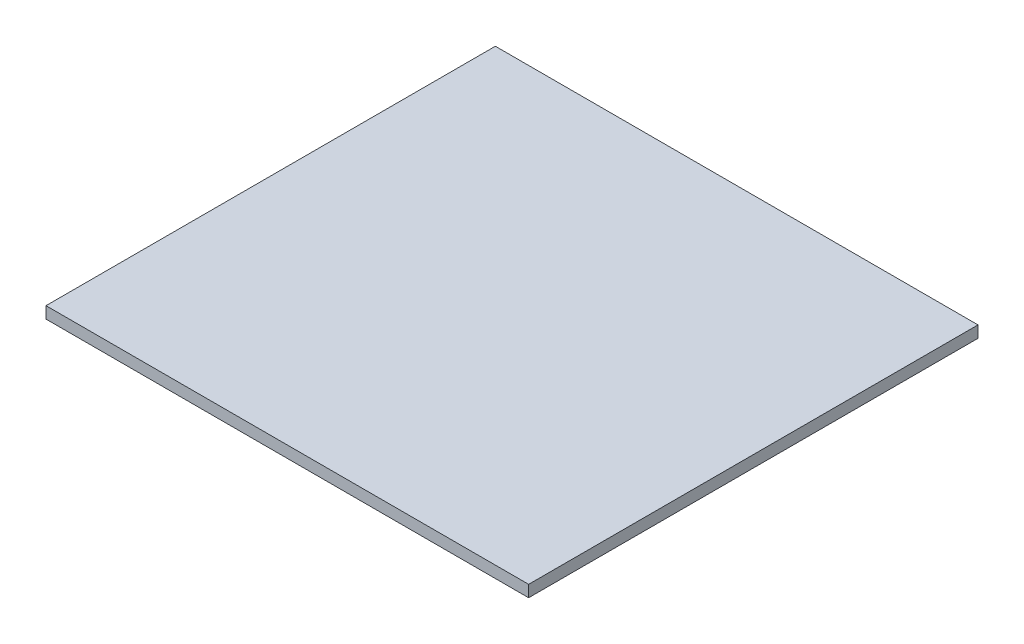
ISO-10303-21;
HEADER;
FILE_DESCRIPTION(('STEP AP214'),'2;1');
FILE_NAME('part.step','',(''),(''),'','','');
FILE_SCHEMA(('AUTOMOTIVE_DESIGN { 1 0 10303 214 1 1 1 1 }'));
ENDSEC;
DATA;
#1=APPLICATION_CONTEXT('core data for automotive mechanical design processes');
#2=APPLICATION_PROTOCOL_DEFINITION('international standard','automotive_design',2000,#1);
#3=PRODUCT_CONTEXT('',#1,'mechanical');
#4=PRODUCT('Part','Part','',(#3));
#5=PRODUCT_RELATED_PRODUCT_CATEGORY('part','',(#4));
#6=PRODUCT_DEFINITION_FORMATION('','',#4);
#7=PRODUCT_DEFINITION_CONTEXT('part definition',#1,'design');
#8=PRODUCT_DEFINITION('design','',#6,#7);
#9=PRODUCT_DEFINITION_SHAPE('','',#8);
#10=(LENGTH_UNIT() NAMED_UNIT(*) SI_UNIT(.MILLI.,.METRE.));
#11=(NAMED_UNIT(*) PLANE_ANGLE_UNIT() SI_UNIT($,.RADIAN.));
#12=(NAMED_UNIT(*) SI_UNIT($,.STERADIAN.) SOLID_ANGLE_UNIT());
#13=UNCERTAINTY_MEASURE_WITH_UNIT(LENGTH_MEASURE(1.E-05),#10,'distance_accuracy_value','');
#14=(GEOMETRIC_REPRESENTATION_CONTEXT(3) GLOBAL_UNCERTAINTY_ASSIGNED_CONTEXT((#13)) GLOBAL_UNIT_ASSIGNED_CONTEXT((#10,
#11,#12)) REPRESENTATION_CONTEXT('',''));
#15=CARTESIAN_POINT('',(0.,0.,0.));
#16=DIRECTION('',(0.,0.,1.));
#17=DIRECTION('',(1.,0.,0.));
#18=AXIS2_PLACEMENT_3D('',#15,#16,#17);
#19=CARTESIAN_POINT('',(145.,7.,135.));
#20=DIRECTION('',(-1.,0.,0.));
#21=DIRECTION('',(0.,0.,1.));
#22=AXIS2_PLACEMENT_3D('',#19,#20,#21);
#23=PLANE('',#22);
#24=DIRECTION('',(0.,0.,-1.));
#25=VECTOR('',#24,1.);
#26=CARTESIAN_POINT('',(145.,0.,135.));
#27=LINE('',#26,#25);
#28=CARTESIAN_POINT('',(145.,0.,135.));
#29=VERTEX_POINT('',#28);
#30=CARTESIAN_POINT('',(145.,0.,-135.));
#31=VERTEX_POINT('',#30);
#32=EDGE_CURVE('E100',#29,#31,#27,.T.);
#33=ORIENTED_EDGE('',*,*,#32,.T.);
#34=DIRECTION('',(0.,-1.,0.));
#35=VECTOR('',#34,1.);
#36=CARTESIAN_POINT('',(145.,7.,-135.));
#37=LINE('',#36,#35);
#38=CARTESIAN_POINT('',(145.,7.,-135.));
#39=VERTEX_POINT('',#38);
#40=EDGE_CURVE('E11',#39,#31,#37,.T.);
#41=ORIENTED_EDGE('',*,*,#40,.F.);
#42=DIRECTION('',(0.,0.,-1.));
#43=VECTOR('',#42,1.);
#44=CARTESIAN_POINT('',(145.,7.,135.));
#45=LINE('',#44,#43);
#46=CARTESIAN_POINT('',(145.,7.,135.));
#47=VERTEX_POINT('',#46);
#48=EDGE_CURVE('E88',#47,#39,#45,.T.);
#49=ORIENTED_EDGE('',*,*,#48,.F.);
#50=DIRECTION('',(0.,-1.,0.));
#51=VECTOR('',#50,1.);
#52=CARTESIAN_POINT('',(145.,7.,135.));
#53=LINE('',#52,#51);
#54=EDGE_CURVE('E96',#47,#29,#53,.T.);
#55=ORIENTED_EDGE('',*,*,#54,.T.);
#56=EDGE_LOOP('',(#33,#41,#49,#55));
#57=FACE_BOUND('',#56,.T.);
#58=ADVANCED_FACE('F37',(#57),#23,.F.);
#59=CARTESIAN_POINT('',(-145.,7.,-135.));
#60=DIRECTION('',(0.,0.,1.));
#61=DIRECTION('',(1.,0.,0.));
#62=AXIS2_PLACEMENT_3D('',#59,#60,#61);
#63=PLANE('',#62);
#64=DIRECTION('',(-1.,0.,0.));
#65=VECTOR('',#64,1.);
#66=CARTESIAN_POINT('',(-145.,0.,-135.));
#67=LINE('',#66,#65);
#68=CARTESIAN_POINT('',(-145.,0.,-135.));
#69=VERTEX_POINT('',#68);
#70=EDGE_CURVE('E92',#31,#69,#67,.T.);
#71=ORIENTED_EDGE('',*,*,#70,.T.);
#72=DIRECTION('',(0.,-1.,0.));
#73=VECTOR('',#72,1.);
#74=CARTESIAN_POINT('',(-145.,7.,-135.));
#75=LINE('',#74,#73);
#76=CARTESIAN_POINT('',(-145.,7.,-135.));
#77=VERTEX_POINT('',#76);
#78=EDGE_CURVE('E45',#77,#69,#75,.T.);
#79=ORIENTED_EDGE('',*,*,#78,.F.);
#80=DIRECTION('',(-1.,0.,0.));
#81=VECTOR('',#80,1.);
#82=CARTESIAN_POINT('',(-145.,7.,-135.));
#83=LINE('',#82,#81);
#84=EDGE_CURVE('E83',#39,#77,#83,.T.);
#85=ORIENTED_EDGE('',*,*,#84,.F.);
#86=ORIENTED_EDGE('',*,*,#40,.T.);
#87=EDGE_LOOP('',(#71,#79,#85,#86));
#88=FACE_BOUND('',#87,.T.);
#89=ADVANCED_FACE('F91',(#88),#63,.F.);
#90=CARTESIAN_POINT('',(-145.,7.,135.));
#91=DIRECTION('',(1.,0.,0.));
#92=DIRECTION('',(0.,0.,-1.));
#93=AXIS2_PLACEMENT_3D('',#90,#91,#92);
#94=PLANE('',#93);
#95=DIRECTION('',(0.,0.,1.));
#96=VECTOR('',#95,1.);
#97=CARTESIAN_POINT('',(-145.,0.,135.));
#98=LINE('',#97,#96);
#99=CARTESIAN_POINT('',(-145.,0.,135.));
#100=VERTEX_POINT('',#99);
#101=EDGE_CURVE('E70',#69,#100,#98,.T.);
#102=ORIENTED_EDGE('',*,*,#101,.T.);
#103=DIRECTION('',(0.,-1.,0.));
#104=VECTOR('',#103,1.);
#105=CARTESIAN_POINT('',(-145.,7.,135.));
#106=LINE('',#105,#104);
#107=CARTESIAN_POINT('',(-145.,7.,135.));
#108=VERTEX_POINT('',#107);
#109=EDGE_CURVE('E93',#108,#100,#106,.T.);
#110=ORIENTED_EDGE('',*,*,#109,.F.);
#111=DIRECTION('',(0.,0.,1.));
#112=VECTOR('',#111,1.);
#113=CARTESIAN_POINT('',(-145.,7.,135.));
#114=LINE('',#113,#112);
#115=EDGE_CURVE('E86',#77,#108,#114,.T.);
#116=ORIENTED_EDGE('',*,*,#115,.F.);
#117=ORIENTED_EDGE('',*,*,#78,.T.);
#118=EDGE_LOOP('',(#102,#110,#116,#117));
#119=FACE_BOUND('',#118,.T.);
#120=ADVANCED_FACE('F94',(#119),#94,.F.);
#121=CARTESIAN_POINT('',(-145.,7.,135.));
#122=DIRECTION('',(0.,0.,-1.));
#123=DIRECTION('',(-1.,0.,0.));
#124=AXIS2_PLACEMENT_3D('',#121,#122,#123);
#125=PLANE('',#124);
#126=DIRECTION('',(1.,0.,0.));
#127=VECTOR('',#126,1.);
#128=CARTESIAN_POINT('',(-145.,0.,135.));
#129=LINE('',#128,#127);
#130=EDGE_CURVE('E76',#100,#29,#129,.T.);
#131=ORIENTED_EDGE('',*,*,#130,.T.);
#132=ORIENTED_EDGE('',*,*,#54,.F.);
#133=DIRECTION('',(1.,0.,0.));
#134=VECTOR('',#133,1.);
#135=CARTESIAN_POINT('',(-145.,7.,135.));
#136=LINE('',#135,#134);
#137=EDGE_CURVE('E53',#108,#47,#136,.T.);
#138=ORIENTED_EDGE('',*,*,#137,.F.);
#139=ORIENTED_EDGE('',*,*,#109,.T.);
#140=EDGE_LOOP('',(#131,#132,#138,#139));
#141=FACE_BOUND('',#140,.T.);
#142=ADVANCED_FACE('F107',(#141),#125,.F.);
#143=CARTESIAN_POINT('',(0.,7.,0.));
#144=DIRECTION('',(0.,-1.,0.));
#145=DIRECTION('',(0.,0.,-1.));
#146=AXIS2_PLACEMENT_3D('',#143,#144,#145);
#147=PLANE('',#146);
#148=ORIENTED_EDGE('',*,*,#48,.T.);
#149=ORIENTED_EDGE('',*,*,#84,.T.);
#150=ORIENTED_EDGE('',*,*,#115,.T.);
#151=ORIENTED_EDGE('',*,*,#137,.T.);
#152=EDGE_LOOP('',(#148,#149,#150,#151));
#153=FACE_BOUND('',#152,.T.);
#154=ADVANCED_FACE('F84',(#153),#147,.F.);
#155=CARTESIAN_POINT('',(0.,0.,0.));
#156=DIRECTION('',(0.,-1.,0.));
#157=DIRECTION('',(0.,0.,-1.));
#158=AXIS2_PLACEMENT_3D('',#155,#156,#157);
#159=PLANE('',#158);
#160=ORIENTED_EDGE('',*,*,#32,.F.);
#161=ORIENTED_EDGE('',*,*,#130,.F.);
#162=ORIENTED_EDGE('',*,*,#101,.F.);
#163=ORIENTED_EDGE('',*,*,#70,.F.);
#164=EDGE_LOOP('',(#160,#161,#162,#163));
#165=FACE_BOUND('',#164,.T.);
#166=ADVANCED_FACE('F110',(#165),#159,.T.);
#167=CLOSED_SHELL('',(#58,#89,#120,#142,#154,#166));
#168=MANIFOLD_SOLID_BREP('B2',#167);
#169=ADVANCED_BREP_SHAPE_REPRESENTATION('',(#18,#168),#14);
#170=SHAPE_DEFINITION_REPRESENTATION(#9,#169);
ENDSEC;
END-ISO-10303-21;
